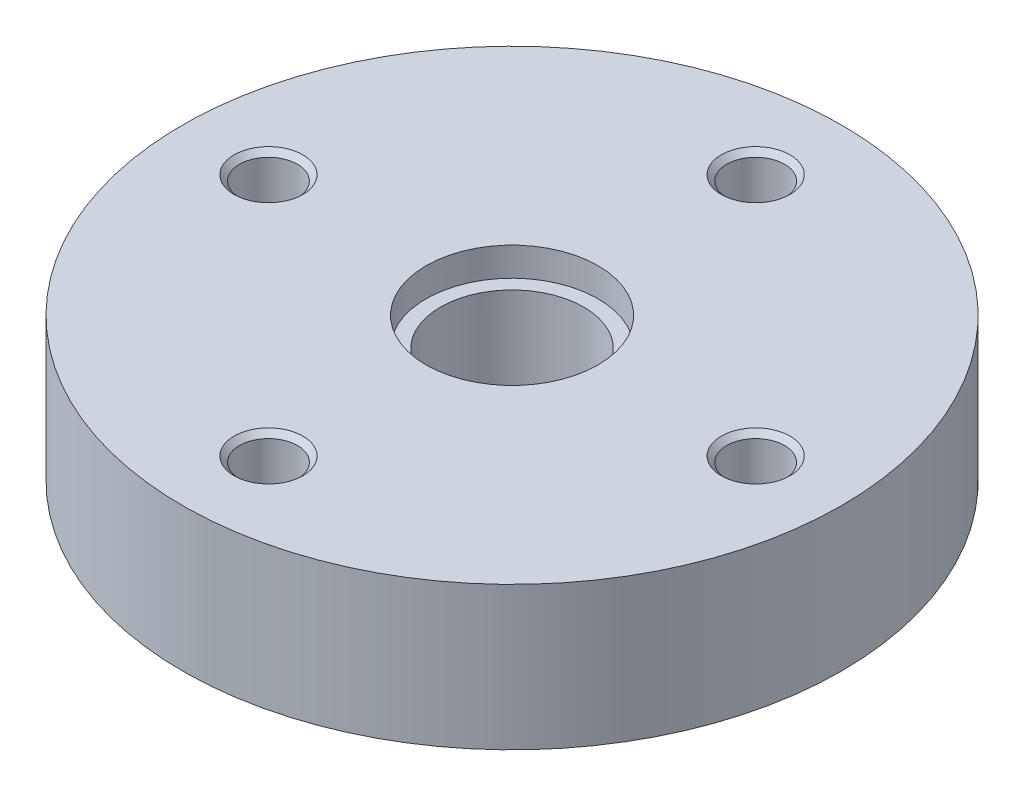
ISO-10303-21;
HEADER;
FILE_DESCRIPTION(('STEP AP214'),'2;1');
FILE_NAME('part.step','',(''),(''),'','','');
FILE_SCHEMA(('AUTOMOTIVE_DESIGN { 1 0 10303 214 1 1 1 1 }'));
ENDSEC;
DATA;
#1=APPLICATION_CONTEXT('core data for automotive mechanical design processes');
#2=APPLICATION_PROTOCOL_DEFINITION('international standard','automotive_design',2000,#1);
#3=PRODUCT_CONTEXT('',#1,'mechanical');
#4=PRODUCT('Part','Part','',(#3));
#5=PRODUCT_RELATED_PRODUCT_CATEGORY('part','',(#4));
#6=PRODUCT_DEFINITION_FORMATION('','',#4);
#7=PRODUCT_DEFINITION_CONTEXT('part definition',#1,'design');
#8=PRODUCT_DEFINITION('design','',#6,#7);
#9=PRODUCT_DEFINITION_SHAPE('','',#8);
#10=(LENGTH_UNIT() NAMED_UNIT(*) SI_UNIT(.MILLI.,.METRE.));
#11=(NAMED_UNIT(*) PLANE_ANGLE_UNIT() SI_UNIT($,.RADIAN.));
#12=(NAMED_UNIT(*) SI_UNIT($,.STERADIAN.) SOLID_ANGLE_UNIT());
#13=UNCERTAINTY_MEASURE_WITH_UNIT(LENGTH_MEASURE(1.E-05),#10,'distance_accuracy_value','');
#14=(GEOMETRIC_REPRESENTATION_CONTEXT(3) GLOBAL_UNCERTAINTY_ASSIGNED_CONTEXT((#13)) GLOBAL_UNIT_ASSIGNED_CONTEXT((#10,
#11,#12)) REPRESENTATION_CONTEXT('',''));
#15=CARTESIAN_POINT('',(0.,0.,0.));
#16=DIRECTION('',(0.,0.,1.));
#17=DIRECTION('',(1.,0.,0.));
#18=AXIS2_PLACEMENT_3D('',#15,#16,#17);
#19=CARTESIAN_POINT('',(0.,12.5,0.));
#20=DIRECTION('',(0.,-1.,0.));
#21=DIRECTION('',(1.,0.,0.));
#22=AXIS2_PLACEMENT_3D('',#19,#20,#21);
#23=CYLINDRICAL_SURFACE('',#22,57.5);
#24=CARTESIAN_POINT('',(0.,0.,0.));
#25=DIRECTION('',(0.,1.,0.));
#26=DIRECTION('',(1.,0.,0.));
#27=AXIS2_PLACEMENT_3D('',#24,#25,#26);
#28=CIRCLE('',#27,57.5);
#29=CARTESIAN_POINT('',(57.5,0.,0.));
#30=VERTEX_POINT('',#29);
#31=EDGE_CURVE('E9',#30,#30,#28,.T.);
#32=ORIENTED_EDGE('',*,*,#31,.T.);
#33=EDGE_LOOP('',(#32));
#34=FACE_BOUND('',#33,.T.);
#35=CARTESIAN_POINT('',(0.,25.,0.));
#36=DIRECTION('',(0.,1.,0.));
#37=DIRECTION('',(1.,0.,0.));
#38=AXIS2_PLACEMENT_3D('',#35,#36,#37);
#39=CIRCLE('',#38,57.5);
#40=CARTESIAN_POINT('',(57.5,25.,0.));
#41=VERTEX_POINT('',#40);
#42=EDGE_CURVE('E84',#41,#41,#39,.T.);
#43=ORIENTED_EDGE('',*,*,#42,.F.);
#44=EDGE_LOOP('',(#43));
#45=FACE_BOUND('',#44,.T.);
#46=ADVANCED_FACE('F15',(#34,#45),#23,.T.);
#47=CARTESIAN_POINT('',(35.,0.,0.));
#48=DIRECTION('',(0.,-1.,0.));
#49=DIRECTION('',(-1.,0.,0.));
#50=AXIS2_PLACEMENT_3D('',#47,#48,#49);
#51=PLANE('',#50);
#52=CARTESIAN_POINT('',(0.,0.,0.));
#53=DIRECTION('',(0.,1.,0.));
#54=DIRECTION('',(1.,0.,0.));
#55=AXIS2_PLACEMENT_3D('',#52,#53,#54);
#56=CIRCLE('',#55,12.5);
#57=CARTESIAN_POINT('',(12.5,0.,0.));
#58=VERTEX_POINT('',#57);
#59=EDGE_CURVE('E23',#58,#58,#56,.T.);
#60=ORIENTED_EDGE('',*,*,#59,.T.);
#61=EDGE_LOOP('',(#60));
#62=FACE_BOUND('',#61,.T.);
#63=ORIENTED_EDGE('',*,*,#31,.F.);
#64=EDGE_LOOP('',(#63));
#65=FACE_BOUND('',#64,.T.);
#66=ADVANCED_FACE('F219',(#62,#65),#51,.T.);
#67=CARTESIAN_POINT('',(0.,12.5,0.));
#68=DIRECTION('',(0.,-1.,0.));
#69=DIRECTION('',(1.,0.,0.));
#70=AXIS2_PLACEMENT_3D('',#67,#68,#69);
#71=CYLINDRICAL_SURFACE('',#70,12.5);
#72=ORIENTED_EDGE('',*,*,#59,.F.);
#73=EDGE_LOOP('',(#72));
#74=FACE_BOUND('',#73,.T.);
#75=CARTESIAN_POINT('',(0.,20.,0.));
#76=DIRECTION('',(0.,1.,0.));
#77=DIRECTION('',(1.,0.,0.));
#78=AXIS2_PLACEMENT_3D('',#75,#76,#77);
#79=CIRCLE('',#78,12.5);
#80=CARTESIAN_POINT('',(-12.5,20.,0.));
#81=VERTEX_POINT('',#80);
#82=EDGE_CURVE('E88',#81,#81,#79,.T.);
#83=ORIENTED_EDGE('',*,*,#82,.T.);
#84=EDGE_LOOP('',(#83));
#85=FACE_BOUND('',#84,.T.);
#86=ADVANCED_FACE('F223',(#74,#85),#71,.F.);
#87=CARTESIAN_POINT('',(35.,25.,0.));
#88=DIRECTION('',(0.,1.,0.));
#89=DIRECTION('',(1.,0.,0.));
#90=AXIS2_PLACEMENT_3D('',#87,#88,#89);
#91=PLANE('',#90);
#92=ORIENTED_EDGE('',*,*,#42,.T.);
#93=EDGE_LOOP('',(#92));
#94=FACE_BOUND('',#93,.T.);
#95=CARTESIAN_POINT('',(0.,25.,0.));
#96=DIRECTION('',(0.,-1.,0.));
#97=DIRECTION('',(1.,0.,0.));
#98=AXIS2_PLACEMENT_3D('',#95,#96,#97);
#99=CIRCLE('',#98,15.);
#100=CARTESIAN_POINT('',(-15.,25.,0.));
#101=VERTEX_POINT('',#100);
#102=EDGE_CURVE('E94',#101,#101,#99,.T.);
#103=ORIENTED_EDGE('',*,*,#102,.T.);
#104=EDGE_LOOP('',(#103));
#105=FACE_BOUND('',#104,.T.);
#106=CARTESIAN_POINT('',(42.5,25.,0.));
#107=DIRECTION('',(0.,-1.,0.));
#108=DIRECTION('',(1.,0.,0.));
#109=AXIS2_PLACEMENT_3D('',#106,#107,#108);
#110=CIRCLE('',#109,6.);
#111=CARTESIAN_POINT('',(48.5,25.,0.));
#112=VERTEX_POINT('',#111);
#113=EDGE_CURVE('E104',#112,#112,#110,.T.);
#114=ORIENTED_EDGE('',*,*,#113,.T.);
#115=EDGE_LOOP('',(#114));
#116=FACE_BOUND('',#115,.T.);
#117=CARTESIAN_POINT('',(0.,25.,-42.5));
#118=DIRECTION('',(0.,-1.,0.));
#119=DIRECTION('',(0.,0.,-1.));
#120=AXIS2_PLACEMENT_3D('',#117,#118,#119);
#121=CIRCLE('',#120,6.);
#122=CARTESIAN_POINT('',(0.,25.,-48.5));
#123=VERTEX_POINT('',#122);
#124=EDGE_CURVE('E116',#123,#123,#121,.T.);
#125=ORIENTED_EDGE('',*,*,#124,.T.);
#126=EDGE_LOOP('',(#125));
#127=FACE_BOUND('',#126,.T.);
#128=CARTESIAN_POINT('',(-42.5,25.,0.));
#129=DIRECTION('',(0.,-1.,0.));
#130=DIRECTION('',(-1.,0.,0.));
#131=AXIS2_PLACEMENT_3D('',#128,#129,#130);
#132=CIRCLE('',#131,6.);
#133=CARTESIAN_POINT('',(-48.5,25.,0.));
#134=VERTEX_POINT('',#133);
#135=EDGE_CURVE('E127',#134,#134,#132,.T.);
#136=ORIENTED_EDGE('',*,*,#135,.T.);
#137=EDGE_LOOP('',(#136));
#138=FACE_BOUND('',#137,.T.);
#139=CARTESIAN_POINT('',(0.,25.,42.5));
#140=DIRECTION('',(0.,-1.,0.));
#141=DIRECTION('',(0.,0.,1.));
#142=AXIS2_PLACEMENT_3D('',#139,#140,#141);
#143=CIRCLE('',#142,6.);
#144=CARTESIAN_POINT('',(0.,25.,48.5));
#145=VERTEX_POINT('',#144);
#146=EDGE_CURVE('E142',#145,#145,#143,.T.);
#147=ORIENTED_EDGE('',*,*,#146,.T.);
#148=EDGE_LOOP('',(#147));
#149=FACE_BOUND('',#148,.T.);
#150=ADVANCED_FACE('F85',(#94,#105,#116,#127,#138,#149),#91,.T.);
#151=CARTESIAN_POINT('',(0.,20.,0.));
#152=DIRECTION('',(0.,-1.,0.));
#153=DIRECTION('',(-1.,0.,0.));
#154=AXIS2_PLACEMENT_3D('',#151,#152,#153);
#155=PLANE('',#154);
#156=CARTESIAN_POINT('',(0.,20.,0.));
#157=DIRECTION('',(0.,-1.,0.));
#158=DIRECTION('',(1.,0.,0.));
#159=AXIS2_PLACEMENT_3D('',#156,#157,#158);
#160=CIRCLE('',#159,15.);
#161=CARTESIAN_POINT('',(15.,20.,0.));
#162=VERTEX_POINT('',#161);
#163=EDGE_CURVE('E90',#162,#162,#160,.T.);
#164=ORIENTED_EDGE('',*,*,#163,.F.);
#165=EDGE_LOOP('',(#164));
#166=FACE_BOUND('',#165,.T.);
#167=ORIENTED_EDGE('',*,*,#82,.F.);
#168=EDGE_LOOP('',(#167));
#169=FACE_BOUND('',#168,.T.);
#170=ADVANCED_FACE('F234',(#166,#169),#155,.F.);
#171=CARTESIAN_POINT('',(0.,23.75,0.));
#172=DIRECTION('',(0.,-1.,0.));
#173=DIRECTION('',(1.,0.,0.));
#174=AXIS2_PLACEMENT_3D('',#171,#172,#173);
#175=CYLINDRICAL_SURFACE('',#174,15.);
#176=ORIENTED_EDGE('',*,*,#163,.T.);
#177=EDGE_LOOP('',(#176));
#178=FACE_BOUND('',#177,.T.);
#179=ORIENTED_EDGE('',*,*,#102,.F.);
#180=EDGE_LOOP('',(#179));
#181=FACE_BOUND('',#180,.T.);
#182=ADVANCED_FACE('F237',(#178,#181),#175,.F.);
#183=CARTESIAN_POINT('',(42.5,5.54137867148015,0.));
#184=DIRECTION('',(0.,1.,0.));
#185=DIRECTION('',(1.,0.,0.));
#186=AXIS2_PLACEMENT_3D('',#183,#184,#185);
#187=CONICAL_SURFACE('',#186,2.52640625,1.0471975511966);
#188=CARTESIAN_POINT('',(42.5,7.,0.));
#189=DIRECTION('',(0.,-1.,0.));
#190=DIRECTION('',(1.,0.,0.));
#191=AXIS2_PLACEMENT_3D('',#188,#189,#190);
#192=CIRCLE('',#191,5.0528125);
#193=CARTESIAN_POINT('',(47.5528125,7.,0.));
#194=VERTEX_POINT('',#193);
#195=EDGE_CURVE('E96',#194,#194,#192,.T.);
#196=ORIENTED_EDGE('',*,*,#195,.F.);
#197=EDGE_LOOP('',(#196));
#198=FACE_BOUND('',#197,.T.);
#199=CARTESIAN_POINT('',(42.5,4.08275734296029,0.));
#200=VERTEX_POINT('',#199);
#201=VERTEX_LOOP('',#200);
#202=FACE_BOUND('',#201,.T.);
#203=ADVANCED_FACE('F241',(#198,#202),#187,.F.);
#204=CARTESIAN_POINT('',(42.5,9.52640625,0.));
#205=DIRECTION('',(0.,1.,0.));
#206=DIRECTION('',(1.,0.,0.));
#207=AXIS2_PLACEMENT_3D('',#204,#205,#206);
#208=CYLINDRICAL_SURFACE('',#207,5.0528125);
#209=CARTESIAN_POINT('',(42.5,12.0528125,0.));
#210=DIRECTION('',(0.,-1.,0.));
#211=DIRECTION('',(1.,0.,0.));
#212=AXIS2_PLACEMENT_3D('',#209,#210,#211);
#213=CIRCLE('',#212,5.0528125);
#214=CARTESIAN_POINT('',(47.5528125,12.0528125,0.));
#215=VERTEX_POINT('',#214);
#216=EDGE_CURVE('E98',#215,#215,#213,.T.);
#217=ORIENTED_EDGE('',*,*,#216,.F.);
#218=EDGE_LOOP('',(#217));
#219=FACE_BOUND('',#218,.T.);
#220=ORIENTED_EDGE('',*,*,#195,.T.);
#221=EDGE_LOOP('',(#220));
#222=FACE_BOUND('',#221,.T.);
#223=ADVANCED_FACE('F243',(#219,#222),#208,.F.);
#224=CARTESIAN_POINT('',(42.5,12.52640625,0.));
#225=DIRECTION('',(0.,1.,0.));
#226=DIRECTION('',(1.,0.,0.));
#227=AXIS2_PLACEMENT_3D('',#224,#225,#226);
#228=CONICAL_SURFACE('',#227,5.52640625,0.785398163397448);
#229=CARTESIAN_POINT('',(42.5,13.,0.));
#230=DIRECTION('',(0.,-1.,0.));
#231=DIRECTION('',(1.,0.,0.));
#232=AXIS2_PLACEMENT_3D('',#229,#230,#231);
#233=CIRCLE('',#232,6.);
#234=CARTESIAN_POINT('',(48.5,13.,0.));
#235=VERTEX_POINT('',#234);
#236=EDGE_CURVE('E99',#235,#235,#233,.T.);
#237=ORIENTED_EDGE('',*,*,#236,.F.);
#238=EDGE_LOOP('',(#237));
#239=FACE_BOUND('',#238,.T.);
#240=ORIENTED_EDGE('',*,*,#216,.T.);
#241=EDGE_LOOP('',(#240));
#242=FACE_BOUND('',#241,.T.);
#243=ADVANCED_FACE('F246',(#239,#242),#228,.F.);
#244=CARTESIAN_POINT('',(48.02640625,13.,0.));
#245=DIRECTION('',(0.,1.,0.));
#246=DIRECTION('',(-1.,0.,0.));
#247=AXIS2_PLACEMENT_3D('',#244,#245,#246);
#248=PLANE('',#247);
#249=CARTESIAN_POINT('',(42.5,13.,0.));
#250=DIRECTION('',(0.,-1.,0.));
#251=DIRECTION('',(1.,0.,0.));
#252=AXIS2_PLACEMENT_3D('',#249,#250,#251);
#253=CIRCLE('',#252,5.0528125);
#254=CARTESIAN_POINT('',(47.5528125,13.,0.));
#255=VERTEX_POINT('',#254);
#256=EDGE_CURVE('E102',#255,#255,#253,.T.);
#257=ORIENTED_EDGE('',*,*,#256,.F.);
#258=EDGE_LOOP('',(#257));
#259=FACE_BOUND('',#258,.T.);
#260=ORIENTED_EDGE('',*,*,#236,.T.);
#261=EDGE_LOOP('',(#260));
#262=FACE_BOUND('',#261,.T.);
#263=ADVANCED_FACE('F250',(#259,#262),#248,.F.);
#264=CARTESIAN_POINT('',(42.5,18.52640625,0.));
#265=DIRECTION('',(0.,1.,0.));
#266=DIRECTION('',(1.,0.,0.));
#267=AXIS2_PLACEMENT_3D('',#264,#265,#266);
#268=CYLINDRICAL_SURFACE('',#267,5.0528125);
#269=CARTESIAN_POINT('',(42.5,24.0528125,0.));
#270=DIRECTION('',(0.,-1.,0.));
#271=DIRECTION('',(1.,0.,0.));
#272=AXIS2_PLACEMENT_3D('',#269,#270,#271);
#273=CIRCLE('',#272,5.0528125);
#274=CARTESIAN_POINT('',(47.5528125,24.0528125,0.));
#275=VERTEX_POINT('',#274);
#276=EDGE_CURVE('E106',#275,#275,#273,.T.);
#277=ORIENTED_EDGE('',*,*,#276,.F.);
#278=EDGE_LOOP('',(#277));
#279=FACE_BOUND('',#278,.T.);
#280=ORIENTED_EDGE('',*,*,#256,.T.);
#281=EDGE_LOOP('',(#280));
#282=FACE_BOUND('',#281,.T.);
#283=ADVANCED_FACE('F254',(#279,#282),#268,.F.);
#284=CARTESIAN_POINT('',(42.5,24.52640625,0.));
#285=DIRECTION('',(0.,1.,0.));
#286=DIRECTION('',(1.,0.,0.));
#287=AXIS2_PLACEMENT_3D('',#284,#285,#286);
#288=CONICAL_SURFACE('',#287,5.52640625,0.785398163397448);
#289=ORIENTED_EDGE('',*,*,#113,.F.);
#290=EDGE_LOOP('',(#289));
#291=FACE_BOUND('',#290,.T.);
#292=ORIENTED_EDGE('',*,*,#276,.T.);
#293=EDGE_LOOP('',(#292));
#294=FACE_BOUND('',#293,.T.);
#295=ADVANCED_FACE('F258',(#291,#294),#288,.F.);
#296=CARTESIAN_POINT('',(0.,5.54137867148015,-42.5));
#297=DIRECTION('',(0.,1.,0.));
#298=DIRECTION('',(0.,0.,-1.));
#299=AXIS2_PLACEMENT_3D('',#296,#297,#298);
#300=CONICAL_SURFACE('',#299,2.52640625,1.0471975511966);
#301=CARTESIAN_POINT('',(0.,7.,-42.5));
#302=DIRECTION('',(0.,-1.,0.));
#303=DIRECTION('',(0.,0.,-1.));
#304=AXIS2_PLACEMENT_3D('',#301,#302,#303);
#305=CIRCLE('',#304,5.0528125);
#306=CARTESIAN_POINT('',(0.,7.,-47.5528125));
#307=VERTEX_POINT('',#306);
#308=EDGE_CURVE('E108',#307,#307,#305,.T.);
#309=ORIENTED_EDGE('',*,*,#308,.F.);
#310=EDGE_LOOP('',(#309));
#311=FACE_BOUND('',#310,.T.);
#312=CARTESIAN_POINT('',(0.,4.08275734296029,-42.5));
#313=VERTEX_POINT('',#312);
#314=VERTEX_LOOP('',#313);
#315=FACE_BOUND('',#314,.T.);
#316=ADVANCED_FACE('F262',(#311,#315),#300,.F.);
#317=CARTESIAN_POINT('',(0.,9.52640625,-42.5));
#318=DIRECTION('',(0.,1.,0.));
#319=DIRECTION('',(0.,0.,-1.));
#320=AXIS2_PLACEMENT_3D('',#317,#318,#319);
#321=CYLINDRICAL_SURFACE('',#320,5.0528125);
#322=CARTESIAN_POINT('',(0.,12.0528125,-42.5));
#323=DIRECTION('',(0.,-1.,0.));
#324=DIRECTION('',(0.,0.,-1.));
#325=AXIS2_PLACEMENT_3D('',#322,#323,#324);
#326=CIRCLE('',#325,5.0528125);
#327=CARTESIAN_POINT('',(0.,12.0528125,-47.5528125));
#328=VERTEX_POINT('',#327);
#329=EDGE_CURVE('E110',#328,#328,#326,.T.);
#330=ORIENTED_EDGE('',*,*,#329,.F.);
#331=EDGE_LOOP('',(#330));
#332=FACE_BOUND('',#331,.T.);
#333=ORIENTED_EDGE('',*,*,#308,.T.);
#334=EDGE_LOOP('',(#333));
#335=FACE_BOUND('',#334,.T.);
#336=ADVANCED_FACE('F266',(#332,#335),#321,.F.);
#337=CARTESIAN_POINT('',(0.,12.52640625,-42.5));
#338=DIRECTION('',(0.,1.,0.));
#339=DIRECTION('',(0.,0.,-1.));
#340=AXIS2_PLACEMENT_3D('',#337,#338,#339);
#341=CONICAL_SURFACE('',#340,5.52640625,0.785398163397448);
#342=CARTESIAN_POINT('',(0.,13.,-42.5));
#343=DIRECTION('',(0.,-1.,0.));
#344=DIRECTION('',(0.,0.,-1.));
#345=AXIS2_PLACEMENT_3D('',#342,#343,#344);
#346=CIRCLE('',#345,6.);
#347=CARTESIAN_POINT('',(0.,13.,-48.5));
#348=VERTEX_POINT('',#347);
#349=EDGE_CURVE('E112',#348,#348,#346,.T.);
#350=ORIENTED_EDGE('',*,*,#349,.F.);
#351=EDGE_LOOP('',(#350));
#352=FACE_BOUND('',#351,.T.);
#353=ORIENTED_EDGE('',*,*,#329,.T.);
#354=EDGE_LOOP('',(#353));
#355=FACE_BOUND('',#354,.T.);
#356=ADVANCED_FACE('F270',(#352,#355),#341,.F.);
#357=CARTESIAN_POINT('',(0.,13.,-48.02640625));
#358=DIRECTION('',(0.,1.,0.));
#359=DIRECTION('',(0.,0.,1.));
#360=AXIS2_PLACEMENT_3D('',#357,#358,#359);
#361=PLANE('',#360);
#362=CARTESIAN_POINT('',(0.,13.,-42.5));
#363=DIRECTION('',(0.,-1.,0.));
#364=DIRECTION('',(0.,0.,-1.));
#365=AXIS2_PLACEMENT_3D('',#362,#363,#364);
#366=CIRCLE('',#365,5.0528125);
#367=CARTESIAN_POINT('',(0.,13.,-47.5528125));
#368=VERTEX_POINT('',#367);
#369=EDGE_CURVE('E114',#368,#368,#366,.T.);
#370=ORIENTED_EDGE('',*,*,#369,.F.);
#371=EDGE_LOOP('',(#370));
#372=FACE_BOUND('',#371,.T.);
#373=ORIENTED_EDGE('',*,*,#349,.T.);
#374=EDGE_LOOP('',(#373));
#375=FACE_BOUND('',#374,.T.);
#376=ADVANCED_FACE('F274',(#372,#375),#361,.F.);
#377=CARTESIAN_POINT('',(0.,18.52640625,-42.5));
#378=DIRECTION('',(0.,1.,0.));
#379=DIRECTION('',(0.,0.,-1.));
#380=AXIS2_PLACEMENT_3D('',#377,#378,#379);
#381=CYLINDRICAL_SURFACE('',#380,5.0528125);
#382=CARTESIAN_POINT('',(0.,24.0528125,-42.5));
#383=DIRECTION('',(0.,-1.,0.));
#384=DIRECTION('',(0.,0.,-1.));
#385=AXIS2_PLACEMENT_3D('',#382,#383,#384);
#386=CIRCLE('',#385,5.0528125);
#387=CARTESIAN_POINT('',(0.,24.0528125,-47.5528125));
#388=VERTEX_POINT('',#387);
#389=EDGE_CURVE('E128',#388,#388,#386,.T.);
#390=ORIENTED_EDGE('',*,*,#389,.F.);
#391=EDGE_LOOP('',(#390));
#392=FACE_BOUND('',#391,.T.);
#393=ORIENTED_EDGE('',*,*,#369,.T.);
#394=EDGE_LOOP('',(#393));
#395=FACE_BOUND('',#394,.T.);
#396=ADVANCED_FACE('F213',(#392,#395),#381,.F.);
#397=CARTESIAN_POINT('',(0.,24.52640625,-42.5));
#398=DIRECTION('',(0.,1.,0.));
#399=DIRECTION('',(0.,0.,-1.));
#400=AXIS2_PLACEMENT_3D('',#397,#398,#399);
#401=CONICAL_SURFACE('',#400,5.52640625,0.785398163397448);
#402=ORIENTED_EDGE('',*,*,#124,.F.);
#403=EDGE_LOOP('',(#402));
#404=FACE_BOUND('',#403,.T.);
#405=ORIENTED_EDGE('',*,*,#389,.T.);
#406=EDGE_LOOP('',(#405));
#407=FACE_BOUND('',#406,.T.);
#408=ADVANCED_FACE('F207',(#404,#407),#401,.F.);
#409=CARTESIAN_POINT('',(-42.5,5.54137867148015,0.));
#410=DIRECTION('',(0.,1.,0.));
#411=DIRECTION('',(-1.,0.,0.));
#412=AXIS2_PLACEMENT_3D('',#409,#410,#411);
#413=CONICAL_SURFACE('',#412,2.52640625,1.0471975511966);
#414=CARTESIAN_POINT('',(-42.5,7.,0.));
#415=DIRECTION('',(0.,-1.,0.));
#416=DIRECTION('',(-1.,0.,0.));
#417=AXIS2_PLACEMENT_3D('',#414,#415,#416);
#418=CIRCLE('',#417,5.0528125);
#419=CARTESIAN_POINT('',(-47.5528125,7.,0.));
#420=VERTEX_POINT('',#419);
#421=EDGE_CURVE('E120',#420,#420,#418,.T.);
#422=ORIENTED_EDGE('',*,*,#421,.F.);
#423=EDGE_LOOP('',(#422));
#424=FACE_BOUND('',#423,.T.);
#425=CARTESIAN_POINT('',(-42.5,4.08275734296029,0.));
#426=VERTEX_POINT('',#425);
#427=VERTEX_LOOP('',#426);
#428=FACE_BOUND('',#427,.T.);
#429=ADVANCED_FACE('F199',(#424,#428),#413,.F.);
#430=CARTESIAN_POINT('',(-42.5,9.52640625,0.));
#431=DIRECTION('',(0.,1.,0.));
#432=DIRECTION('',(-1.,0.,0.));
#433=AXIS2_PLACEMENT_3D('',#430,#431,#432);
#434=CYLINDRICAL_SURFACE('',#433,5.0528125);
#435=CARTESIAN_POINT('',(-42.5,12.0528125,0.));
#436=DIRECTION('',(0.,-1.,0.));
#437=DIRECTION('',(-1.,0.,0.));
#438=AXIS2_PLACEMENT_3D('',#435,#436,#437);
#439=CIRCLE('',#438,5.0528125);
#440=CARTESIAN_POINT('',(-47.5528125,12.0528125,0.));
#441=VERTEX_POINT('',#440);
#442=EDGE_CURVE('E117',#441,#441,#439,.T.);
#443=ORIENTED_EDGE('',*,*,#442,.F.);
#444=EDGE_LOOP('',(#443));
#445=FACE_BOUND('',#444,.T.);
#446=ORIENTED_EDGE('',*,*,#421,.T.);
#447=EDGE_LOOP('',(#446));
#448=FACE_BOUND('',#447,.T.);
#449=ADVANCED_FACE('F191',(#445,#448),#434,.F.);
#450=CARTESIAN_POINT('',(-42.5,12.52640625,0.));
#451=DIRECTION('',(0.,1.,0.));
#452=DIRECTION('',(-1.,0.,0.));
#453=AXIS2_PLACEMENT_3D('',#450,#451,#452);
#454=CONICAL_SURFACE('',#453,5.52640625,0.785398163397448);
#455=CARTESIAN_POINT('',(-42.5,13.,0.));
#456=DIRECTION('',(0.,-1.,0.));
#457=DIRECTION('',(-1.,0.,0.));
#458=AXIS2_PLACEMENT_3D('',#455,#456,#457);
#459=CIRCLE('',#458,6.);
#460=CARTESIAN_POINT('',(-48.5,13.,0.));
#461=VERTEX_POINT('',#460);
#462=EDGE_CURVE('E121',#461,#461,#459,.T.);
#463=ORIENTED_EDGE('',*,*,#462,.F.);
#464=EDGE_LOOP('',(#463));
#465=FACE_BOUND('',#464,.T.);
#466=ORIENTED_EDGE('',*,*,#442,.T.);
#467=EDGE_LOOP('',(#466));
#468=FACE_BOUND('',#467,.T.);
#469=ADVANCED_FACE('F184',(#465,#468),#454,.F.);
#470=CARTESIAN_POINT('',(-48.02640625,13.,0.));
#471=DIRECTION('',(0.,1.,0.));
#472=DIRECTION('',(1.,0.,0.));
#473=AXIS2_PLACEMENT_3D('',#470,#471,#472);
#474=PLANE('',#473);
#475=CARTESIAN_POINT('',(-42.5,13.,0.));
#476=DIRECTION('',(0.,-1.,0.));
#477=DIRECTION('',(-1.,0.,0.));
#478=AXIS2_PLACEMENT_3D('',#475,#476,#477);
#479=CIRCLE('',#478,5.0528125);
#480=CARTESIAN_POINT('',(-47.5528125,13.,0.));
#481=VERTEX_POINT('',#480);
#482=EDGE_CURVE('E124',#481,#481,#479,.T.);
#483=ORIENTED_EDGE('',*,*,#482,.F.);
#484=EDGE_LOOP('',(#483));
#485=FACE_BOUND('',#484,.T.);
#486=ORIENTED_EDGE('',*,*,#462,.T.);
#487=EDGE_LOOP('',(#486));
#488=FACE_BOUND('',#487,.T.);
#489=ADVANCED_FACE('F178',(#485,#488),#474,.F.);
#490=CARTESIAN_POINT('',(-42.5,18.52640625,0.));
#491=DIRECTION('',(0.,1.,0.));
#492=DIRECTION('',(-1.,0.,0.));
#493=AXIS2_PLACEMENT_3D('',#490,#491,#492);
#494=CYLINDRICAL_SURFACE('',#493,5.0528125);
#495=CARTESIAN_POINT('',(-42.5,24.0528125,0.));
#496=DIRECTION('',(0.,-1.,0.));
#497=DIRECTION('',(-1.,0.,0.));
#498=AXIS2_PLACEMENT_3D('',#495,#496,#497);
#499=CIRCLE('',#498,5.0528125);
#500=CARTESIAN_POINT('',(-47.5528125,24.0528125,0.));
#501=VERTEX_POINT('',#500);
#502=EDGE_CURVE('E143',#501,#501,#499,.T.);
#503=ORIENTED_EDGE('',*,*,#502,.F.);
#504=EDGE_LOOP('',(#503));
#505=FACE_BOUND('',#504,.T.);
#506=ORIENTED_EDGE('',*,*,#482,.T.);
#507=EDGE_LOOP('',(#506));
#508=FACE_BOUND('',#507,.T.);
#509=ADVANCED_FACE('F170',(#505,#508),#494,.F.);
#510=CARTESIAN_POINT('',(-42.5,24.52640625,0.));
#511=DIRECTION('',(0.,1.,0.));
#512=DIRECTION('',(-1.,0.,0.));
#513=AXIS2_PLACEMENT_3D('',#510,#511,#512);
#514=CONICAL_SURFACE('',#513,5.52640625,0.785398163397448);
#515=ORIENTED_EDGE('',*,*,#135,.F.);
#516=EDGE_LOOP('',(#515));
#517=FACE_BOUND('',#516,.T.);
#518=ORIENTED_EDGE('',*,*,#502,.T.);
#519=EDGE_LOOP('',(#518));
#520=FACE_BOUND('',#519,.T.);
#521=ADVANCED_FACE('F166',(#517,#520),#514,.F.);
#522=CARTESIAN_POINT('',(0.,5.54137867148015,42.5));
#523=DIRECTION('',(0.,1.,0.));
#524=DIRECTION('',(0.,0.,1.));
#525=AXIS2_PLACEMENT_3D('',#522,#523,#524);
#526=CONICAL_SURFACE('',#525,2.52640625,1.0471975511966);
#527=CARTESIAN_POINT('',(0.,7.,42.5));
#528=DIRECTION('',(0.,-1.,0.));
#529=DIRECTION('',(0.,0.,1.));
#530=AXIS2_PLACEMENT_3D('',#527,#528,#529);
#531=CIRCLE('',#530,5.0528125);
#532=CARTESIAN_POINT('',(0.,7.,47.5528125));
#533=VERTEX_POINT('',#532);
#534=EDGE_CURVE('E134',#533,#533,#531,.T.);
#535=ORIENTED_EDGE('',*,*,#534,.F.);
#536=EDGE_LOOP('',(#535));
#537=FACE_BOUND('',#536,.T.);
#538=CARTESIAN_POINT('',(0.,4.08275734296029,42.5));
#539=VERTEX_POINT('',#538);
#540=VERTEX_LOOP('',#539);
#541=FACE_BOUND('',#540,.T.);
#542=ADVANCED_FACE('F169',(#537,#541),#526,.F.);
#543=CARTESIAN_POINT('',(0.,9.52640625,42.5));
#544=DIRECTION('',(0.,1.,0.));
#545=DIRECTION('',(0.,0.,1.));
#546=AXIS2_PLACEMENT_3D('',#543,#544,#545);
#547=CYLINDRICAL_SURFACE('',#546,5.0528125);
#548=CARTESIAN_POINT('',(0.,12.0528125,42.5));
#549=DIRECTION('',(0.,-1.,0.));
#550=DIRECTION('',(0.,0.,1.));
#551=AXIS2_PLACEMENT_3D('',#548,#549,#550);
#552=CIRCLE('',#551,5.0528125);
#553=CARTESIAN_POINT('',(0.,12.0528125,47.5528125));
#554=VERTEX_POINT('',#553);
#555=EDGE_CURVE('E131',#554,#554,#552,.T.);
#556=ORIENTED_EDGE('',*,*,#555,.F.);
#557=EDGE_LOOP('',(#556));
#558=FACE_BOUND('',#557,.T.);
#559=ORIENTED_EDGE('',*,*,#534,.T.);
#560=EDGE_LOOP('',(#559));
#561=FACE_BOUND('',#560,.T.);
#562=ADVANCED_FACE('F284',(#558,#561),#547,.F.);
#563=CARTESIAN_POINT('',(0.,12.52640625,42.5));
#564=DIRECTION('',(0.,1.,0.));
#565=DIRECTION('',(0.,0.,1.));
#566=AXIS2_PLACEMENT_3D('',#563,#564,#565);
#567=CONICAL_SURFACE('',#566,5.52640625,0.785398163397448);
#568=CARTESIAN_POINT('',(0.,13.,42.5));
#569=DIRECTION('',(0.,-1.,0.));
#570=DIRECTION('',(0.,0.,1.));
#571=AXIS2_PLACEMENT_3D('',#568,#569,#570);
#572=CIRCLE('',#571,6.);
#573=CARTESIAN_POINT('',(0.,13.,48.5));
#574=VERTEX_POINT('',#573);
#575=EDGE_CURVE('E135',#574,#574,#572,.T.);
#576=ORIENTED_EDGE('',*,*,#575,.F.);
#577=EDGE_LOOP('',(#576));
#578=FACE_BOUND('',#577,.T.);
#579=ORIENTED_EDGE('',*,*,#555,.T.);
#580=EDGE_LOOP('',(#579));
#581=FACE_BOUND('',#580,.T.);
#582=ADVANCED_FACE('F286',(#578,#581),#567,.F.);
#583=CARTESIAN_POINT('',(0.,13.,48.02640625));
#584=DIRECTION('',(0.,1.,0.));
#585=DIRECTION('',(0.,0.,-1.));
#586=AXIS2_PLACEMENT_3D('',#583,#584,#585);
#587=PLANE('',#586);
#588=CARTESIAN_POINT('',(0.,13.,42.5));
#589=DIRECTION('',(0.,-1.,0.));
#590=DIRECTION('',(0.,0.,1.));
#591=AXIS2_PLACEMENT_3D('',#588,#589,#590);
#592=CIRCLE('',#591,5.0528125);
#593=CARTESIAN_POINT('',(0.,13.,47.5528125));
#594=VERTEX_POINT('',#593);
#595=EDGE_CURVE('E139',#594,#594,#592,.T.);
#596=ORIENTED_EDGE('',*,*,#595,.F.);
#597=EDGE_LOOP('',(#596));
#598=FACE_BOUND('',#597,.T.);
#599=ORIENTED_EDGE('',*,*,#575,.T.);
#600=EDGE_LOOP('',(#599));
#601=FACE_BOUND('',#600,.T.);
#602=ADVANCED_FACE('F289',(#598,#601),#587,.F.);
#603=CARTESIAN_POINT('',(0.,18.52640625,42.5));
#604=DIRECTION('',(0.,1.,0.));
#605=DIRECTION('',(0.,0.,1.));
#606=AXIS2_PLACEMENT_3D('',#603,#604,#605);
#607=CYLINDRICAL_SURFACE('',#606,5.0528125);
#608=CARTESIAN_POINT('',(0.,24.0528125,42.5));
#609=DIRECTION('',(0.,-1.,0.));
#610=DIRECTION('',(0.,0.,1.));
#611=AXIS2_PLACEMENT_3D('',#608,#609,#610);
#612=CIRCLE('',#611,5.0528125);
#613=CARTESIAN_POINT('',(0.,24.0528125,47.5528125));
#614=VERTEX_POINT('',#613);
#615=EDGE_CURVE('E152',#614,#614,#612,.T.);
#616=ORIENTED_EDGE('',*,*,#615,.F.);
#617=EDGE_LOOP('',(#616));
#618=FACE_BOUND('',#617,.T.);
#619=ORIENTED_EDGE('',*,*,#595,.T.);
#620=EDGE_LOOP('',(#619));
#621=FACE_BOUND('',#620,.T.);
#622=ADVANCED_FACE('F294',(#618,#621),#607,.F.);
#623=CARTESIAN_POINT('',(0.,24.52640625,42.5));
#624=DIRECTION('',(0.,1.,0.));
#625=DIRECTION('',(0.,0.,1.));
#626=AXIS2_PLACEMENT_3D('',#623,#624,#625);
#627=CONICAL_SURFACE('',#626,5.52640625,0.785398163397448);
#628=ORIENTED_EDGE('',*,*,#146,.F.);
#629=EDGE_LOOP('',(#628));
#630=FACE_BOUND('',#629,.T.);
#631=ORIENTED_EDGE('',*,*,#615,.T.);
#632=EDGE_LOOP('',(#631));
#633=FACE_BOUND('',#632,.T.);
#634=ADVANCED_FACE('F299',(#630,#633),#627,.F.);
#635=CLOSED_SHELL('',(#46,#66,#86,#150,#170,#182,#203,#223,#243,#263,#283,#295,#316,#336,#356,
#376,#396,#408,#429,#449,#469,#489,#509,#521,#542,#562,#582,#602,#622,#634));
#636=MANIFOLD_SOLID_BREP('B1',#635);
#637=ADVANCED_BREP_SHAPE_REPRESENTATION('',(#18,#636),#14);
#638=SHAPE_DEFINITION_REPRESENTATION(#9,#637);
ENDSEC;
END-ISO-10303-21;
